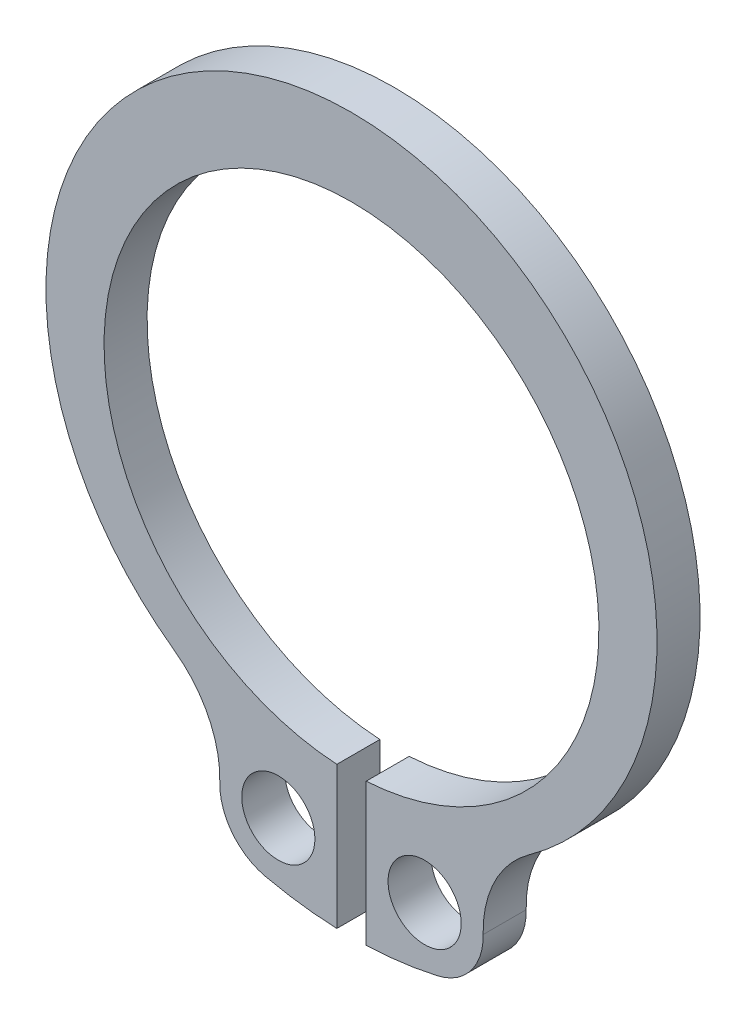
ISO-10303-21;
HEADER;
FILE_DESCRIPTION(('STEP AP214'),'2;1');
FILE_NAME('part.step','',(''),(''),'','','');
FILE_SCHEMA(('AUTOMOTIVE_DESIGN { 1 0 10303 214 1 1 1 1 }'));
ENDSEC;
DATA;
#1=APPLICATION_CONTEXT('core data for automotive mechanical design processes');
#2=APPLICATION_PROTOCOL_DEFINITION('international standard','automotive_design',2000,#1);
#3=PRODUCT_CONTEXT('',#1,'mechanical');
#4=PRODUCT('Part','Part','',(#3));
#5=PRODUCT_RELATED_PRODUCT_CATEGORY('part','',(#4));
#6=PRODUCT_DEFINITION_FORMATION('','',#4);
#7=PRODUCT_DEFINITION_CONTEXT('part definition',#1,'design');
#8=PRODUCT_DEFINITION('design','',#6,#7);
#9=PRODUCT_DEFINITION_SHAPE('','',#8);
#10=(LENGTH_UNIT() NAMED_UNIT(*) SI_UNIT(.MILLI.,.METRE.));
#11=(NAMED_UNIT(*) PLANE_ANGLE_UNIT() SI_UNIT($,.RADIAN.));
#12=(NAMED_UNIT(*) SI_UNIT($,.STERADIAN.) SOLID_ANGLE_UNIT());
#13=UNCERTAINTY_MEASURE_WITH_UNIT(LENGTH_MEASURE(1.E-05),#10,'distance_accuracy_value','');
#14=(GEOMETRIC_REPRESENTATION_CONTEXT(3) GLOBAL_UNCERTAINTY_ASSIGNED_CONTEXT((#13)) GLOBAL_UNIT_ASSIGNED_CONTEXT((#10,
#11,#12)) REPRESENTATION_CONTEXT('',''));
#15=CARTESIAN_POINT('',(0.,0.,0.));
#16=DIRECTION('',(0.,0.,1.));
#17=DIRECTION('',(1.,0.,0.));
#18=AXIS2_PLACEMENT_3D('',#15,#16,#17);
#19=CARTESIAN_POINT('',(0.,0.45,1.));
#20=DIRECTION('',(0.,0.,1.));
#21=DIRECTION('',(1.,0.,0.));
#22=AXIS2_PLACEMENT_3D('',#19,#20,#21);
#23=PLANE('',#22);
#24=CARTESIAN_POINT('',(1.7,-7.5,1.));
#25=DIRECTION('',(0.,0.,1.));
#26=DIRECTION('',(1.,0.,0.));
#27=AXIS2_PLACEMENT_3D('',#24,#25,#26);
#28=CIRCLE('',#27,0.85);
#29=CARTESIAN_POINT('',(2.55,-7.5,1.));
#30=VERTEX_POINT('',#29);
#31=EDGE_CURVE('E147',#30,#30,#28,.T.);
#32=ORIENTED_EDGE('',*,*,#31,.F.);
#33=EDGE_LOOP('',(#32));
#34=FACE_BOUND('',#33,.T.);
#35=CARTESIAN_POINT('',(0.,0.45,1.));
#36=DIRECTION('',(0.,0.,1.));
#37=DIRECTION('',(1.,0.,0.));
#38=AXIS2_PLACEMENT_3D('',#35,#36,#37);
#39=CIRCLE('',#38,7.1);
#40=CARTESIAN_POINT('',(4.1266728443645,-5.32759216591,1.));
#41=VERTEX_POINT('',#40);
#42=CARTESIAN_POINT('',(-4.1266728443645,-5.32759216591,1.));
#43=VERTEX_POINT('',#42);
#44=EDGE_CURVE('E162',#41,#43,#39,.T.);
#45=ORIENTED_EDGE('',*,*,#44,.T.);
#46=CARTESIAN_POINT('',(-5.60878773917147,-7.40264287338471,1.));
#47=DIRECTION('',(0.,0.,-1.));
#48=DIRECTION('',(1.,0.,0.));
#49=AXIS2_PLACEMENT_3D('',#46,#47,#48);
#50=CIRCLE('',#49,2.55);
#51=CARTESIAN_POINT('',(-3.05957834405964,-7.46613665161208,1.));
#52=VERTEX_POINT('',#51);
#53=EDGE_CURVE('E100',#43,#52,#50,.T.);
#54=ORIENTED_EDGE('',*,*,#53,.T.);
#55=CARTESIAN_POINT('',(-1.7,-7.5,1.));
#56=DIRECTION('',(0.,0.,1.));
#57=DIRECTION('',(1.,0.,0.));
#58=AXIS2_PLACEMENT_3D('',#55,#56,#57);
#59=CIRCLE('',#58,1.36);
#60=CARTESIAN_POINT('',(-2.00064028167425,-8.82635418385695,1.));
#61=VERTEX_POINT('',#60);
#62=EDGE_CURVE('E183',#52,#61,#59,.T.);
#63=ORIENTED_EDGE('',*,*,#62,.T.);
#64=CARTESIAN_POINT('',(0.,0.,1.));
#65=DIRECTION('',(0.,0.,1.));
#66=DIRECTION('',(1.,0.,0.));
#67=AXIS2_PLACEMENT_3D('',#64,#65,#66);
#68=CIRCLE('',#67,9.05025357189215);
#69=CARTESIAN_POINT('',(-0.339999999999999,-9.04386475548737,1.));
#70=VERTEX_POINT('',#69);
#71=EDGE_CURVE('E202',#61,#70,#68,.T.);
#72=ORIENTED_EDGE('',*,*,#71,.T.);
#73=DIRECTION('',(0.,1.,0.));
#74=VECTOR('',#73,1.);
#75=CARTESIAN_POINT('',(-0.339999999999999,-5.73993902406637,1.));
#76=LINE('',#75,#74);
#77=CARTESIAN_POINT('',(-0.339999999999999,-5.73993902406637,1.));
#78=VERTEX_POINT('',#77);
#79=EDGE_CURVE('E199',#70,#78,#76,.T.);
#80=ORIENTED_EDGE('',*,*,#79,.T.);
#81=CARTESIAN_POINT('',(0.,0.,1.));
#82=DIRECTION('',(0.,0.,-1.));
#83=DIRECTION('',(1.,0.,0.));
#84=AXIS2_PLACEMENT_3D('',#81,#82,#83);
#85=CIRCLE('',#84,5.75);
#86=CARTESIAN_POINT('',(0.340000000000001,-5.73993902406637,1.));
#87=VERTEX_POINT('',#86);
#88=EDGE_CURVE('E201',#78,#87,#85,.T.);
#89=ORIENTED_EDGE('',*,*,#88,.T.);
#90=DIRECTION('',(0.,-1.,0.));
#91=VECTOR('',#90,1.);
#92=CARTESIAN_POINT('',(0.340000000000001,-5.73993902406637,1.));
#93=LINE('',#92,#91);
#94=CARTESIAN_POINT('',(0.34,-9.04386475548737,1.));
#95=VERTEX_POINT('',#94);
#96=EDGE_CURVE('E125',#87,#95,#93,.T.);
#97=ORIENTED_EDGE('',*,*,#96,.T.);
#98=CARTESIAN_POINT('',(0.,0.,1.));
#99=DIRECTION('',(0.,0.,1.));
#100=DIRECTION('',(1.,0.,0.));
#101=AXIS2_PLACEMENT_3D('',#98,#99,#100);
#102=CIRCLE('',#101,9.05025357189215);
#103=CARTESIAN_POINT('',(2.00064028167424,-8.82635418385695,1.));
#104=VERTEX_POINT('',#103);
#105=EDGE_CURVE('E119',#95,#104,#102,.T.);
#106=ORIENTED_EDGE('',*,*,#105,.T.);
#107=CARTESIAN_POINT('',(1.7,-7.5,1.));
#108=DIRECTION('',(0.,0.,1.));
#109=DIRECTION('',(1.,0.,0.));
#110=AXIS2_PLACEMENT_3D('',#107,#108,#109);
#111=CIRCLE('',#110,1.36);
#112=CARTESIAN_POINT('',(3.05957834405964,-7.46613665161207,1.));
#113=VERTEX_POINT('',#112);
#114=EDGE_CURVE('E123',#104,#113,#111,.T.);
#115=ORIENTED_EDGE('',*,*,#114,.T.);
#116=CARTESIAN_POINT('',(5.60878773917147,-7.40264287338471,1.));
#117=DIRECTION('',(0.,0.,-1.));
#118=DIRECTION('',(1.,0.,0.));
#119=AXIS2_PLACEMENT_3D('',#116,#117,#118);
#120=CIRCLE('',#119,2.55);
#121=EDGE_CURVE('E51',#113,#41,#120,.T.);
#122=ORIENTED_EDGE('',*,*,#121,.T.);
#123=EDGE_LOOP('',(#45,#54,#63,#72,#80,#89,#97,#106,#115,#122));
#124=FACE_BOUND('',#123,.T.);
#125=CARTESIAN_POINT('',(-1.7,-7.5,1.));
#126=DIRECTION('',(0.,0.,1.));
#127=DIRECTION('',(1.,0.,0.));
#128=AXIS2_PLACEMENT_3D('',#125,#126,#127);
#129=CIRCLE('',#128,0.85);
#130=CARTESIAN_POINT('',(-0.849999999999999,-7.5,1.));
#131=VERTEX_POINT('',#130);
#132=EDGE_CURVE('E213',#131,#131,#129,.T.);
#133=ORIENTED_EDGE('',*,*,#132,.F.);
#134=EDGE_LOOP('',(#133));
#135=FACE_BOUND('',#134,.T.);
#136=ADVANCED_FACE('F34',(#34,#124,#135),#23,.T.);
#137=CARTESIAN_POINT('',(0.,0.45,0.));
#138=DIRECTION('',(0.,0.,1.));
#139=DIRECTION('',(1.,0.,0.));
#140=AXIS2_PLACEMENT_3D('',#137,#138,#139);
#141=PLANE('',#140);
#142=CARTESIAN_POINT('',(1.7,-7.5,0.));
#143=DIRECTION('',(0.,0.,1.));
#144=DIRECTION('',(1.,0.,0.));
#145=AXIS2_PLACEMENT_3D('',#142,#143,#144);
#146=CIRCLE('',#145,0.85);
#147=CARTESIAN_POINT('',(2.55,-7.5,0.));
#148=VERTEX_POINT('',#147);
#149=EDGE_CURVE('E210',#148,#148,#146,.T.);
#150=ORIENTED_EDGE('',*,*,#149,.T.);
#151=EDGE_LOOP('',(#150));
#152=FACE_BOUND('',#151,.T.);
#153=CARTESIAN_POINT('',(0.,0.45,0.));
#154=DIRECTION('',(0.,0.,1.));
#155=DIRECTION('',(1.,0.,0.));
#156=AXIS2_PLACEMENT_3D('',#153,#154,#155);
#157=CIRCLE('',#156,7.1);
#158=CARTESIAN_POINT('',(4.1266728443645,-5.32759216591,0.));
#159=VERTEX_POINT('',#158);
#160=CARTESIAN_POINT('',(-4.1266728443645,-5.32759216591,0.));
#161=VERTEX_POINT('',#160);
#162=EDGE_CURVE('E143',#159,#161,#157,.T.);
#163=ORIENTED_EDGE('',*,*,#162,.F.);
#164=CARTESIAN_POINT('',(5.60878773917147,-7.40264287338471,0.));
#165=DIRECTION('',(0.,0.,-1.));
#166=DIRECTION('',(1.,0.,0.));
#167=AXIS2_PLACEMENT_3D('',#164,#165,#166);
#168=CIRCLE('',#167,2.55);
#169=CARTESIAN_POINT('',(3.05957834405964,-7.46613665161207,0.));
#170=VERTEX_POINT('',#169);
#171=EDGE_CURVE('E92',#170,#159,#168,.T.);
#172=ORIENTED_EDGE('',*,*,#171,.F.);
#173=CARTESIAN_POINT('',(1.7,-7.5,0.));
#174=DIRECTION('',(0.,0.,1.));
#175=DIRECTION('',(1.,0.,0.));
#176=AXIS2_PLACEMENT_3D('',#173,#174,#175);
#177=CIRCLE('',#176,1.36);
#178=CARTESIAN_POINT('',(2.00064028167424,-8.82635418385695,0.));
#179=VERTEX_POINT('',#178);
#180=EDGE_CURVE('E86',#179,#170,#177,.T.);
#181=ORIENTED_EDGE('',*,*,#180,.F.);
#182=CARTESIAN_POINT('',(0.,0.,0.));
#183=DIRECTION('',(0.,0.,1.));
#184=DIRECTION('',(1.,0.,0.));
#185=AXIS2_PLACEMENT_3D('',#182,#183,#184);
#186=CIRCLE('',#185,9.05025357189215);
#187=CARTESIAN_POINT('',(0.34,-9.04386475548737,0.));
#188=VERTEX_POINT('',#187);
#189=EDGE_CURVE('E133',#188,#179,#186,.T.);
#190=ORIENTED_EDGE('',*,*,#189,.F.);
#191=DIRECTION('',(0.,-1.,0.));
#192=VECTOR('',#191,1.);
#193=CARTESIAN_POINT('',(0.340000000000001,-5.73993902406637,0.));
#194=LINE('',#193,#192);
#195=CARTESIAN_POINT('',(0.340000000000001,-5.73993902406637,0.));
#196=VERTEX_POINT('',#195);
#197=EDGE_CURVE('E157',#196,#188,#194,.T.);
#198=ORIENTED_EDGE('',*,*,#197,.F.);
#199=CARTESIAN_POINT('',(0.,0.,0.));
#200=DIRECTION('',(0.,0.,-1.));
#201=DIRECTION('',(1.,0.,0.));
#202=AXIS2_PLACEMENT_3D('',#199,#200,#201);
#203=CIRCLE('',#202,5.75);
#204=CARTESIAN_POINT('',(-0.339999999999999,-5.73993902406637,0.));
#205=VERTEX_POINT('',#204);
#206=EDGE_CURVE('E155',#205,#196,#203,.T.);
#207=ORIENTED_EDGE('',*,*,#206,.F.);
#208=DIRECTION('',(0.,1.,0.));
#209=VECTOR('',#208,1.);
#210=CARTESIAN_POINT('',(-0.339999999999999,-5.73993902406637,0.));
#211=LINE('',#210,#209);
#212=CARTESIAN_POINT('',(-0.339999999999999,-9.04386475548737,0.));
#213=VERTEX_POINT('',#212);
#214=EDGE_CURVE('E153',#213,#205,#211,.T.);
#215=ORIENTED_EDGE('',*,*,#214,.F.);
#216=CARTESIAN_POINT('',(0.,0.,0.));
#217=DIRECTION('',(0.,0.,1.));
#218=DIRECTION('',(1.,0.,0.));
#219=AXIS2_PLACEMENT_3D('',#216,#217,#218);
#220=CIRCLE('',#219,9.05025357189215);
#221=CARTESIAN_POINT('',(-2.00064028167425,-8.82635418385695,0.));
#222=VERTEX_POINT('',#221);
#223=EDGE_CURVE('E151',#222,#213,#220,.T.);
#224=ORIENTED_EDGE('',*,*,#223,.F.);
#225=CARTESIAN_POINT('',(-1.7,-7.5,0.));
#226=DIRECTION('',(0.,0.,1.));
#227=DIRECTION('',(1.,0.,0.));
#228=AXIS2_PLACEMENT_3D('',#225,#226,#227);
#229=CIRCLE('',#228,1.36);
#230=CARTESIAN_POINT('',(-3.05957834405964,-7.46613665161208,0.));
#231=VERTEX_POINT('',#230);
#232=EDGE_CURVE('E149',#231,#222,#229,.T.);
#233=ORIENTED_EDGE('',*,*,#232,.F.);
#234=CARTESIAN_POINT('',(-5.60878773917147,-7.40264287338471,0.));
#235=DIRECTION('',(0.,0.,-1.));
#236=DIRECTION('',(1.,0.,0.));
#237=AXIS2_PLACEMENT_3D('',#234,#235,#236);
#238=CIRCLE('',#237,2.55);
#239=EDGE_CURVE('E146',#161,#231,#238,.T.);
#240=ORIENTED_EDGE('',*,*,#239,.F.);
#241=EDGE_LOOP('',(#163,#172,#181,#190,#198,#207,#215,#224,#233,#240));
#242=FACE_BOUND('',#241,.T.);
#243=CARTESIAN_POINT('',(-1.7,-7.5,0.));
#244=DIRECTION('',(0.,0.,1.));
#245=DIRECTION('',(1.,0.,0.));
#246=AXIS2_PLACEMENT_3D('',#243,#244,#245);
#247=CIRCLE('',#246,0.85);
#248=CARTESIAN_POINT('',(-0.849999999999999,-7.5,0.));
#249=VERTEX_POINT('',#248);
#250=EDGE_CURVE('E216',#249,#249,#247,.T.);
#251=ORIENTED_EDGE('',*,*,#250,.T.);
#252=EDGE_LOOP('',(#251));
#253=FACE_BOUND('',#252,.T.);
#254=ADVANCED_FACE('F187',(#152,#242,#253),#141,.F.);
#255=CARTESIAN_POINT('',(0.,0.45,1.));
#256=DIRECTION('',(0.,0.,-1.));
#257=DIRECTION('',(-1.,0.,0.));
#258=AXIS2_PLACEMENT_3D('',#255,#256,#257);
#259=CYLINDRICAL_SURFACE('',#258,7.1);
#260=ORIENTED_EDGE('',*,*,#162,.T.);
#261=DIRECTION('',(0.,0.,-1.));
#262=VECTOR('',#261,1.);
#263=CARTESIAN_POINT('',(-4.1266728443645,-5.32759216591,1.));
#264=LINE('',#263,#262);
#265=EDGE_CURVE('E11',#43,#161,#264,.T.);
#266=ORIENTED_EDGE('',*,*,#265,.F.);
#267=ORIENTED_EDGE('',*,*,#44,.F.);
#268=DIRECTION('',(0.,0.,-1.));
#269=VECTOR('',#268,1.);
#270=CARTESIAN_POINT('',(4.1266728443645,-5.32759216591,1.));
#271=LINE('',#270,#269);
#272=EDGE_CURVE('E139',#41,#159,#271,.T.);
#273=ORIENTED_EDGE('',*,*,#272,.T.);
#274=EDGE_LOOP('',(#260,#266,#267,#273));
#275=FACE_BOUND('',#274,.T.);
#276=ADVANCED_FACE('F36',(#275),#259,.T.);
#277=CARTESIAN_POINT('',(-5.60878773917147,-7.40264287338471,1.));
#278=DIRECTION('',(0.,0.,-1.));
#279=DIRECTION('',(-1.,0.,0.));
#280=AXIS2_PLACEMENT_3D('',#277,#278,#279);
#281=CYLINDRICAL_SURFACE('',#280,2.55);
#282=ORIENTED_EDGE('',*,*,#239,.T.);
#283=DIRECTION('',(0.,0.,-1.));
#284=VECTOR('',#283,1.);
#285=CARTESIAN_POINT('',(-3.05957834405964,-7.46613665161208,1.));
#286=LINE('',#285,#284);
#287=EDGE_CURVE('E43',#52,#231,#286,.T.);
#288=ORIENTED_EDGE('',*,*,#287,.F.);
#289=ORIENTED_EDGE('',*,*,#53,.F.);
#290=ORIENTED_EDGE('',*,*,#265,.T.);
#291=EDGE_LOOP('',(#282,#288,#289,#290));
#292=FACE_BOUND('',#291,.T.);
#293=ADVANCED_FACE('F257',(#292),#281,.F.);
#294=CARTESIAN_POINT('',(-1.7,-7.5,1.));
#295=DIRECTION('',(0.,0.,-1.));
#296=DIRECTION('',(-1.,0.,0.));
#297=AXIS2_PLACEMENT_3D('',#294,#295,#296);
#298=CYLINDRICAL_SURFACE('',#297,1.36);
#299=ORIENTED_EDGE('',*,*,#232,.T.);
#300=DIRECTION('',(0.,0.,-1.));
#301=VECTOR('',#300,1.);
#302=CARTESIAN_POINT('',(-2.00064028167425,-8.82635418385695,1.));
#303=LINE('',#302,#301);
#304=EDGE_CURVE('E175',#61,#222,#303,.T.);
#305=ORIENTED_EDGE('',*,*,#304,.F.);
#306=ORIENTED_EDGE('',*,*,#62,.F.);
#307=ORIENTED_EDGE('',*,*,#287,.T.);
#308=EDGE_LOOP('',(#299,#305,#306,#307));
#309=FACE_BOUND('',#308,.T.);
#310=ADVANCED_FACE('F181',(#309),#298,.T.);
#311=CARTESIAN_POINT('',(0.,0.,1.));
#312=DIRECTION('',(0.,0.,-1.));
#313=DIRECTION('',(-1.,0.,0.));
#314=AXIS2_PLACEMENT_3D('',#311,#312,#313);
#315=CYLINDRICAL_SURFACE('',#314,9.05025357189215);
#316=ORIENTED_EDGE('',*,*,#223,.T.);
#317=DIRECTION('',(0.,0.,-1.));
#318=VECTOR('',#317,1.);
#319=CARTESIAN_POINT('',(-0.339999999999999,-9.04386475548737,1.));
#320=LINE('',#319,#318);
#321=EDGE_CURVE('E172',#70,#213,#320,.T.);
#322=ORIENTED_EDGE('',*,*,#321,.F.);
#323=ORIENTED_EDGE('',*,*,#71,.F.);
#324=ORIENTED_EDGE('',*,*,#304,.T.);
#325=EDGE_LOOP('',(#316,#322,#323,#324));
#326=FACE_BOUND('',#325,.T.);
#327=ADVANCED_FACE('F193',(#326),#315,.T.);
#328=CARTESIAN_POINT('',(-0.339999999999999,-5.73993902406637,1.));
#329=DIRECTION('',(-1.,0.,0.));
#330=DIRECTION('',(0.,-1.,0.));
#331=AXIS2_PLACEMENT_3D('',#328,#329,#330);
#332=PLANE('',#331);
#333=ORIENTED_EDGE('',*,*,#214,.T.);
#334=DIRECTION('',(0.,0.,-1.));
#335=VECTOR('',#334,1.);
#336=CARTESIAN_POINT('',(-0.339999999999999,-5.73993902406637,1.));
#337=LINE('',#336,#335);
#338=EDGE_CURVE('E169',#78,#205,#337,.T.);
#339=ORIENTED_EDGE('',*,*,#338,.F.);
#340=ORIENTED_EDGE('',*,*,#79,.F.);
#341=ORIENTED_EDGE('',*,*,#321,.T.);
#342=EDGE_LOOP('',(#333,#339,#340,#341));
#343=FACE_BOUND('',#342,.T.);
#344=ADVANCED_FACE('F197',(#343),#332,.F.);
#345=CARTESIAN_POINT('',(0.,0.,1.));
#346=DIRECTION('',(0.,0.,-1.));
#347=DIRECTION('',(-1.,0.,0.));
#348=AXIS2_PLACEMENT_3D('',#345,#346,#347);
#349=CYLINDRICAL_SURFACE('',#348,5.75);
#350=ORIENTED_EDGE('',*,*,#206,.T.);
#351=DIRECTION('',(0.,0.,-1.));
#352=VECTOR('',#351,1.);
#353=CARTESIAN_POINT('',(0.340000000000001,-5.73993902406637,1.));
#354=LINE('',#353,#352);
#355=EDGE_CURVE('E166',#87,#196,#354,.T.);
#356=ORIENTED_EDGE('',*,*,#355,.F.);
#357=ORIENTED_EDGE('',*,*,#88,.F.);
#358=ORIENTED_EDGE('',*,*,#338,.T.);
#359=EDGE_LOOP('',(#350,#356,#357,#358));
#360=FACE_BOUND('',#359,.T.);
#361=ADVANCED_FACE('F247',(#360),#349,.F.);
#362=CARTESIAN_POINT('',(0.340000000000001,-5.73993902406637,1.));
#363=DIRECTION('',(1.,0.,0.));
#364=DIRECTION('',(0.,1.,0.));
#365=AXIS2_PLACEMENT_3D('',#362,#363,#364);
#366=PLANE('',#365);
#367=ORIENTED_EDGE('',*,*,#197,.T.);
#368=DIRECTION('',(0.,0.,-1.));
#369=VECTOR('',#368,1.);
#370=CARTESIAN_POINT('',(0.34,-9.04386475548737,1.));
#371=LINE('',#370,#369);
#372=EDGE_CURVE('E134',#95,#188,#371,.T.);
#373=ORIENTED_EDGE('',*,*,#372,.F.);
#374=ORIENTED_EDGE('',*,*,#96,.F.);
#375=ORIENTED_EDGE('',*,*,#355,.T.);
#376=EDGE_LOOP('',(#367,#373,#374,#375));
#377=FACE_BOUND('',#376,.T.);
#378=ADVANCED_FACE('F244',(#377),#366,.F.);
#379=CARTESIAN_POINT('',(0.,0.,1.));
#380=DIRECTION('',(0.,0.,-1.));
#381=DIRECTION('',(-1.,0.,0.));
#382=AXIS2_PLACEMENT_3D('',#379,#380,#381);
#383=CYLINDRICAL_SURFACE('',#382,9.05025357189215);
#384=ORIENTED_EDGE('',*,*,#189,.T.);
#385=DIRECTION('',(0.,0.,-1.));
#386=VECTOR('',#385,1.);
#387=CARTESIAN_POINT('',(2.00064028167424,-8.82635418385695,1.));
#388=LINE('',#387,#386);
#389=EDGE_CURVE('E130',#104,#179,#388,.T.);
#390=ORIENTED_EDGE('',*,*,#389,.F.);
#391=ORIENTED_EDGE('',*,*,#105,.F.);
#392=ORIENTED_EDGE('',*,*,#372,.T.);
#393=EDGE_LOOP('',(#384,#390,#391,#392));
#394=FACE_BOUND('',#393,.T.);
#395=ADVANCED_FACE('F131',(#394),#383,.T.);
#396=CARTESIAN_POINT('',(1.7,-7.5,1.));
#397=DIRECTION('',(0.,0.,-1.));
#398=DIRECTION('',(-1.,0.,0.));
#399=AXIS2_PLACEMENT_3D('',#396,#397,#398);
#400=CYLINDRICAL_SURFACE('',#399,1.36);
#401=ORIENTED_EDGE('',*,*,#180,.T.);
#402=DIRECTION('',(0.,0.,-1.));
#403=VECTOR('',#402,1.);
#404=CARTESIAN_POINT('',(3.05957834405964,-7.46613665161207,1.));
#405=LINE('',#404,#403);
#406=EDGE_CURVE('E135',#113,#170,#405,.T.);
#407=ORIENTED_EDGE('',*,*,#406,.F.);
#408=ORIENTED_EDGE('',*,*,#114,.F.);
#409=ORIENTED_EDGE('',*,*,#389,.T.);
#410=EDGE_LOOP('',(#401,#407,#408,#409));
#411=FACE_BOUND('',#410,.T.);
#412=ADVANCED_FACE('F137',(#411),#400,.T.);
#413=CARTESIAN_POINT('',(5.60878773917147,-7.40264287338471,1.));
#414=DIRECTION('',(0.,0.,-1.));
#415=DIRECTION('',(-1.,0.,0.));
#416=AXIS2_PLACEMENT_3D('',#413,#414,#415);
#417=CYLINDRICAL_SURFACE('',#416,2.55);
#418=ORIENTED_EDGE('',*,*,#171,.T.);
#419=ORIENTED_EDGE('',*,*,#272,.F.);
#420=ORIENTED_EDGE('',*,*,#121,.F.);
#421=ORIENTED_EDGE('',*,*,#406,.T.);
#422=EDGE_LOOP('',(#418,#419,#420,#421));
#423=FACE_BOUND('',#422,.T.);
#424=ADVANCED_FACE('F237',(#423),#417,.F.);
#425=CARTESIAN_POINT('',(1.7,-7.5,1.));
#426=DIRECTION('',(0.,0.,-1.));
#427=DIRECTION('',(-1.,0.,0.));
#428=AXIS2_PLACEMENT_3D('',#425,#426,#427);
#429=CYLINDRICAL_SURFACE('',#428,0.85);
#430=ORIENTED_EDGE('',*,*,#31,.T.);
#431=EDGE_LOOP('',(#430));
#432=FACE_BOUND('',#431,.T.);
#433=ORIENTED_EDGE('',*,*,#149,.F.);
#434=EDGE_LOOP('',(#433));
#435=FACE_BOUND('',#434,.T.);
#436=ADVANCED_FACE('F234',(#432,#435),#429,.F.);
#437=CARTESIAN_POINT('',(-1.7,-7.5,1.));
#438=DIRECTION('',(0.,0.,-1.));
#439=DIRECTION('',(-1.,0.,0.));
#440=AXIS2_PLACEMENT_3D('',#437,#438,#439);
#441=CYLINDRICAL_SURFACE('',#440,0.85);
#442=ORIENTED_EDGE('',*,*,#132,.T.);
#443=EDGE_LOOP('',(#442));
#444=FACE_BOUND('',#443,.T.);
#445=ORIENTED_EDGE('',*,*,#250,.F.);
#446=EDGE_LOOP('',(#445));
#447=FACE_BOUND('',#446,.T.);
#448=ADVANCED_FACE('F222',(#444,#447),#441,.F.);
#449=CLOSED_SHELL('',(#136,#254,#276,#293,#310,#327,#344,#361,#378,#395,#412,#424,#436,#448));
#450=MANIFOLD_SOLID_BREP('B2',#449);
#451=ADVANCED_BREP_SHAPE_REPRESENTATION('',(#18,#450),#14);
#452=SHAPE_DEFINITION_REPRESENTATION(#9,#451);
ENDSEC;
END-ISO-10303-21;
